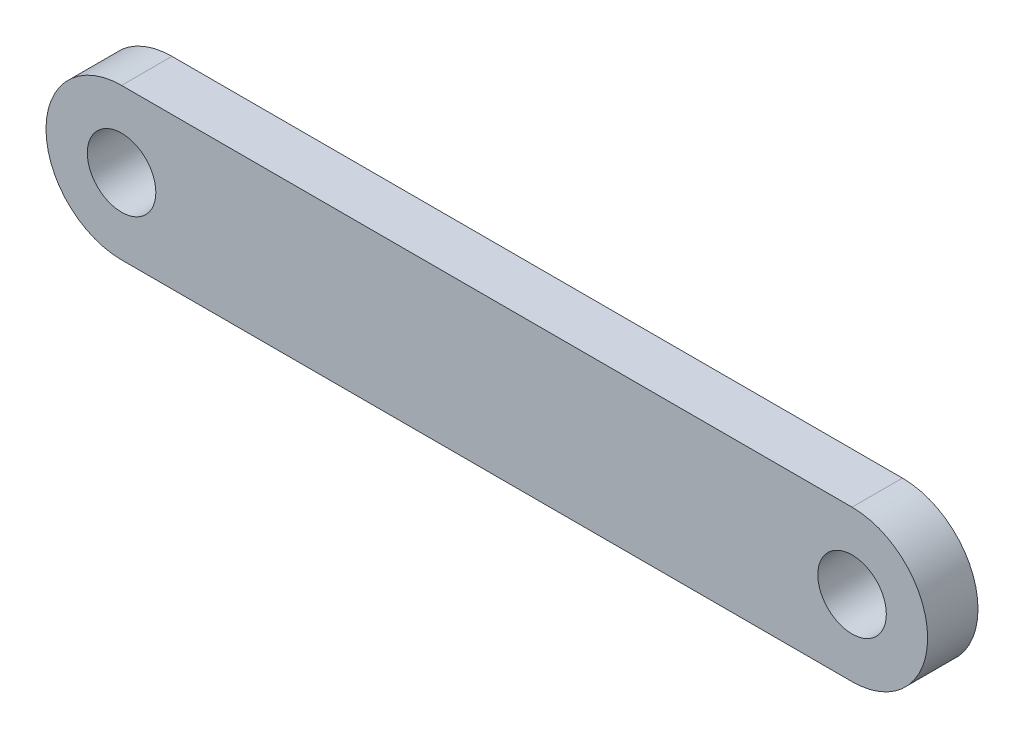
ISO-10303-21;
HEADER;
FILE_DESCRIPTION(('STEP AP214'),'2;1');
FILE_NAME('part.step','',(''),(''),'','','');
FILE_SCHEMA(('AUTOMOTIVE_DESIGN { 1 0 10303 214 1 1 1 1 }'));
ENDSEC;
DATA;
#1=APPLICATION_CONTEXT('core data for automotive mechanical design processes');
#2=APPLICATION_PROTOCOL_DEFINITION('international standard','automotive_design',2000,#1);
#3=PRODUCT_CONTEXT('',#1,'mechanical');
#4=PRODUCT('Part','Part','',(#3));
#5=PRODUCT_RELATED_PRODUCT_CATEGORY('part','',(#4));
#6=PRODUCT_DEFINITION_FORMATION('','',#4);
#7=PRODUCT_DEFINITION_CONTEXT('part definition',#1,'design');
#8=PRODUCT_DEFINITION('design','',#6,#7);
#9=PRODUCT_DEFINITION_SHAPE('','',#8);
#10=(LENGTH_UNIT() NAMED_UNIT(*) SI_UNIT(.MILLI.,.METRE.));
#11=(NAMED_UNIT(*) PLANE_ANGLE_UNIT() SI_UNIT($,.RADIAN.));
#12=(NAMED_UNIT(*) SI_UNIT($,.STERADIAN.) SOLID_ANGLE_UNIT());
#13=UNCERTAINTY_MEASURE_WITH_UNIT(LENGTH_MEASURE(1.E-05),#10,'distance_accuracy_value','');
#14=(GEOMETRIC_REPRESENTATION_CONTEXT(3) GLOBAL_UNCERTAINTY_ASSIGNED_CONTEXT((#13)) GLOBAL_UNIT_ASSIGNED_CONTEXT((#10,
#11,#12)) REPRESENTATION_CONTEXT('',''));
#15=CARTESIAN_POINT('',(0.,0.,0.));
#16=DIRECTION('',(0.,0.,1.));
#17=DIRECTION('',(1.,0.,0.));
#18=AXIS2_PLACEMENT_3D('',#15,#16,#17);
#19=CARTESIAN_POINT('',(-47.625,23.495,2.54));
#20=DIRECTION('',(0.,0.,-1.));
#21=DIRECTION('',(-1.,0.,0.));
#22=AXIS2_PLACEMENT_3D('',#19,#20,#21);
#23=CYLINDRICAL_SURFACE('',#22,3.80999999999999);
#24=CARTESIAN_POINT('',(-47.625,23.495,0.));
#25=DIRECTION('',(0.,0.,1.));
#26=DIRECTION('',(1.,0.,0.));
#27=AXIS2_PLACEMENT_3D('',#24,#25,#26);
#28=CIRCLE('',#27,3.80999999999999);
#29=CARTESIAN_POINT('',(-47.625,27.305,0.));
#30=VERTEX_POINT('',#29);
#31=CARTESIAN_POINT('',(-47.625,19.685,0.));
#32=VERTEX_POINT('',#31);
#33=EDGE_CURVE('E98',#30,#32,#28,.T.);
#34=ORIENTED_EDGE('',*,*,#33,.T.);
#35=DIRECTION('',(0.,0.,-1.));
#36=VECTOR('',#35,1.);
#37=CARTESIAN_POINT('',(-47.625,19.685,2.54));
#38=LINE('',#37,#36);
#39=CARTESIAN_POINT('',(-47.625,19.685,2.54));
#40=VERTEX_POINT('',#39);
#41=EDGE_CURVE('E11',#40,#32,#38,.T.);
#42=ORIENTED_EDGE('',*,*,#41,.F.);
#43=CARTESIAN_POINT('',(-47.625,23.495,2.54));
#44=DIRECTION('',(0.,0.,1.));
#45=DIRECTION('',(1.,0.,0.));
#46=AXIS2_PLACEMENT_3D('',#43,#44,#45);
#47=CIRCLE('',#46,3.80999999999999);
#48=CARTESIAN_POINT('',(-47.625,27.305,2.54));
#49=VERTEX_POINT('',#48);
#50=EDGE_CURVE('E85',#49,#40,#47,.T.);
#51=ORIENTED_EDGE('',*,*,#50,.F.);
#52=DIRECTION('',(0.,0.,-1.));
#53=VECTOR('',#52,1.);
#54=CARTESIAN_POINT('',(-47.625,27.305,2.54));
#55=LINE('',#54,#53);
#56=EDGE_CURVE('E94',#49,#30,#55,.T.);
#57=ORIENTED_EDGE('',*,*,#56,.T.);
#58=EDGE_LOOP('',(#34,#42,#51,#57));
#59=FACE_BOUND('',#58,.T.);
#60=ADVANCED_FACE('F32',(#59),#23,.T.);
#61=CARTESIAN_POINT('',(-47.625,19.685,2.54));
#62=DIRECTION('',(0.,1.,0.));
#63=DIRECTION('',(-1.,0.,0.));
#64=AXIS2_PLACEMENT_3D('',#61,#62,#63);
#65=PLANE('',#64);
#66=DIRECTION('',(1.,0.,0.));
#67=VECTOR('',#66,1.);
#68=CARTESIAN_POINT('',(-47.625,19.685,0.));
#69=LINE('',#68,#67);
#70=CARTESIAN_POINT('',(-10.795,19.685,0.));
#71=VERTEX_POINT('',#70);
#72=EDGE_CURVE('E89',#32,#71,#69,.T.);
#73=ORIENTED_EDGE('',*,*,#72,.T.);
#74=DIRECTION('',(0.,0.,-1.));
#75=VECTOR('',#74,1.);
#76=CARTESIAN_POINT('',(-10.795,19.685,2.54));
#77=LINE('',#76,#75);
#78=CARTESIAN_POINT('',(-10.795,19.685,2.54));
#79=VERTEX_POINT('',#78);
#80=EDGE_CURVE('E41',#79,#71,#77,.T.);
#81=ORIENTED_EDGE('',*,*,#80,.F.);
#82=DIRECTION('',(1.,0.,0.));
#83=VECTOR('',#82,1.);
#84=CARTESIAN_POINT('',(-47.625,19.685,2.54));
#85=LINE('',#84,#83);
#86=EDGE_CURVE('E80',#40,#79,#85,.T.);
#87=ORIENTED_EDGE('',*,*,#86,.F.);
#88=ORIENTED_EDGE('',*,*,#41,.T.);
#89=EDGE_LOOP('',(#73,#81,#87,#88));
#90=FACE_BOUND('',#89,.T.);
#91=ADVANCED_FACE('F88',(#90),#65,.F.);
#92=CARTESIAN_POINT('',(-10.795,23.495,2.54));
#93=DIRECTION('',(0.,0.,-1.));
#94=DIRECTION('',(-1.,0.,0.));
#95=AXIS2_PLACEMENT_3D('',#92,#93,#94);
#96=CYLINDRICAL_SURFACE('',#95,3.80999999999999);
#97=CARTESIAN_POINT('',(-10.795,23.495,0.));
#98=DIRECTION('',(0.,0.,1.));
#99=DIRECTION('',(1.,0.,0.));
#100=AXIS2_PLACEMENT_3D('',#97,#98,#99);
#101=CIRCLE('',#100,3.80999999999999);
#102=CARTESIAN_POINT('',(-10.795,27.305,0.));
#103=VERTEX_POINT('',#102);
#104=EDGE_CURVE('E67',#71,#103,#101,.T.);
#105=ORIENTED_EDGE('',*,*,#104,.T.);
#106=DIRECTION('',(0.,0.,-1.));
#107=VECTOR('',#106,1.);
#108=CARTESIAN_POINT('',(-10.795,27.305,2.54));
#109=LINE('',#108,#107);
#110=CARTESIAN_POINT('',(-10.795,27.305,2.54));
#111=VERTEX_POINT('',#110);
#112=EDGE_CURVE('E90',#111,#103,#109,.T.);
#113=ORIENTED_EDGE('',*,*,#112,.F.);
#114=CARTESIAN_POINT('',(-10.795,23.495,2.54));
#115=DIRECTION('',(0.,0.,1.));
#116=DIRECTION('',(1.,0.,0.));
#117=AXIS2_PLACEMENT_3D('',#114,#115,#116);
#118=CIRCLE('',#117,3.80999999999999);
#119=EDGE_CURVE('E83',#79,#111,#118,.T.);
#120=ORIENTED_EDGE('',*,*,#119,.F.);
#121=ORIENTED_EDGE('',*,*,#80,.T.);
#122=EDGE_LOOP('',(#105,#113,#120,#121));
#123=FACE_BOUND('',#122,.T.);
#124=ADVANCED_FACE('F92',(#123),#96,.T.);
#125=CARTESIAN_POINT('',(-47.625,27.305,2.54));
#126=DIRECTION('',(0.,-1.,0.));
#127=DIRECTION('',(1.,0.,0.));
#128=AXIS2_PLACEMENT_3D('',#125,#126,#127);
#129=PLANE('',#128);
#130=DIRECTION('',(-1.,0.,0.));
#131=VECTOR('',#130,1.);
#132=CARTESIAN_POINT('',(-47.625,27.305,0.));
#133=LINE('',#132,#131);
#134=EDGE_CURVE('E73',#103,#30,#133,.T.);
#135=ORIENTED_EDGE('',*,*,#134,.T.);
#136=ORIENTED_EDGE('',*,*,#56,.F.);
#137=DIRECTION('',(-1.,0.,0.));
#138=VECTOR('',#137,1.);
#139=CARTESIAN_POINT('',(-47.625,27.305,2.54));
#140=LINE('',#139,#138);
#141=EDGE_CURVE('E50',#111,#49,#140,.T.);
#142=ORIENTED_EDGE('',*,*,#141,.F.);
#143=ORIENTED_EDGE('',*,*,#112,.T.);
#144=EDGE_LOOP('',(#135,#136,#142,#143));
#145=FACE_BOUND('',#144,.T.);
#146=ADVANCED_FACE('F126',(#145),#129,.F.);
#147=CARTESIAN_POINT('',(-47.625,23.495,2.54));
#148=DIRECTION('',(0.,0.,1.));
#149=DIRECTION('',(1.,0.,0.));
#150=AXIS2_PLACEMENT_3D('',#147,#148,#149);
#151=PLANE('',#150);
#152=CARTESIAN_POINT('',(-47.625,23.495,2.54));
#153=DIRECTION('',(0.,0.,1.));
#154=DIRECTION('',(1.,0.,0.));
#155=AXIS2_PLACEMENT_3D('',#152,#153,#154);
#156=CIRCLE('',#155,1.7272);
#157=CARTESIAN_POINT('',(-45.8978,23.495,2.54));
#158=VERTEX_POINT('',#157);
#159=EDGE_CURVE('E115',#158,#158,#156,.T.);
#160=ORIENTED_EDGE('',*,*,#159,.F.);
#161=EDGE_LOOP('',(#160));
#162=FACE_BOUND('',#161,.T.);
#163=CARTESIAN_POINT('',(-10.795,23.495,2.54));
#164=DIRECTION('',(0.,0.,1.));
#165=DIRECTION('',(1.,0.,0.));
#166=AXIS2_PLACEMENT_3D('',#163,#164,#165);
#167=CIRCLE('',#166,1.7272);
#168=CARTESIAN_POINT('',(-9.0678,23.495,2.54));
#169=VERTEX_POINT('',#168);
#170=EDGE_CURVE('E107',#169,#169,#167,.T.);
#171=ORIENTED_EDGE('',*,*,#170,.F.);
#172=EDGE_LOOP('',(#171));
#173=FACE_BOUND('',#172,.T.);
#174=ORIENTED_EDGE('',*,*,#50,.T.);
#175=ORIENTED_EDGE('',*,*,#86,.T.);
#176=ORIENTED_EDGE('',*,*,#119,.T.);
#177=ORIENTED_EDGE('',*,*,#141,.T.);
#178=EDGE_LOOP('',(#174,#175,#176,#177));
#179=FACE_BOUND('',#178,.T.);
#180=ADVANCED_FACE('F81',(#162,#173,#179),#151,.T.);
#181=CARTESIAN_POINT('',(-47.625,23.495,0.));
#182=DIRECTION('',(0.,0.,1.));
#183=DIRECTION('',(1.,0.,0.));
#184=AXIS2_PLACEMENT_3D('',#181,#182,#183);
#185=PLANE('',#184);
#186=CARTESIAN_POINT('',(-47.625,23.495,0.));
#187=DIRECTION('',(0.,0.,1.));
#188=DIRECTION('',(1.,0.,0.));
#189=AXIS2_PLACEMENT_3D('',#186,#187,#188);
#190=CIRCLE('',#189,1.7272);
#191=CARTESIAN_POINT('',(-45.8978,23.495,0.));
#192=VERTEX_POINT('',#191);
#193=EDGE_CURVE('E35',#192,#192,#190,.T.);
#194=ORIENTED_EDGE('',*,*,#193,.T.);
#195=EDGE_LOOP('',(#194));
#196=FACE_BOUND('',#195,.T.);
#197=CARTESIAN_POINT('',(-10.795,23.495,0.));
#198=DIRECTION('',(0.,0.,1.));
#199=DIRECTION('',(1.,0.,0.));
#200=AXIS2_PLACEMENT_3D('',#197,#198,#199);
#201=CIRCLE('',#200,1.7272);
#202=CARTESIAN_POINT('',(-9.0678,23.495,0.));
#203=VERTEX_POINT('',#202);
#204=EDGE_CURVE('E101',#203,#203,#201,.T.);
#205=ORIENTED_EDGE('',*,*,#204,.T.);
#206=EDGE_LOOP('',(#205));
#207=FACE_BOUND('',#206,.T.);
#208=ORIENTED_EDGE('',*,*,#33,.F.);
#209=ORIENTED_EDGE('',*,*,#134,.F.);
#210=ORIENTED_EDGE('',*,*,#104,.F.);
#211=ORIENTED_EDGE('',*,*,#72,.F.);
#212=EDGE_LOOP('',(#208,#209,#210,#211));
#213=FACE_BOUND('',#212,.T.);
#214=ADVANCED_FACE('F125',(#196,#207,#213),#185,.F.);
#215=CARTESIAN_POINT('',(-10.795,23.495,2.54));
#216=DIRECTION('',(0.,0.,1.));
#217=DIRECTION('',(1.,0.,0.));
#218=AXIS2_PLACEMENT_3D('',#215,#216,#217);
#219=CYLINDRICAL_SURFACE('',#218,1.7272);
#220=ORIENTED_EDGE('',*,*,#170,.T.);
#221=EDGE_LOOP('',(#220));
#222=FACE_BOUND('',#221,.T.);
#223=ORIENTED_EDGE('',*,*,#204,.F.);
#224=EDGE_LOOP('',(#223));
#225=FACE_BOUND('',#224,.T.);
#226=ADVANCED_FACE('F132',(#222,#225),#219,.F.);
#227=CARTESIAN_POINT('',(-47.625,23.495,2.54));
#228=DIRECTION('',(0.,0.,1.));
#229=DIRECTION('',(1.,0.,0.));
#230=AXIS2_PLACEMENT_3D('',#227,#228,#229);
#231=CYLINDRICAL_SURFACE('',#230,1.7272);
#232=ORIENTED_EDGE('',*,*,#159,.T.);
#233=EDGE_LOOP('',(#232));
#234=FACE_BOUND('',#233,.T.);
#235=ORIENTED_EDGE('',*,*,#193,.F.);
#236=EDGE_LOOP('',(#235));
#237=FACE_BOUND('',#236,.T.);
#238=ADVANCED_FACE('F120',(#234,#237),#231,.F.);
#239=CLOSED_SHELL('',(#60,#91,#124,#146,#180,#214,#226,#238));
#240=MANIFOLD_SOLID_BREP('B2',#239);
#241=ADVANCED_BREP_SHAPE_REPRESENTATION('',(#18,#240),#14);
#242=SHAPE_DEFINITION_REPRESENTATION(#9,#241);
ENDSEC;
END-ISO-10303-21;
